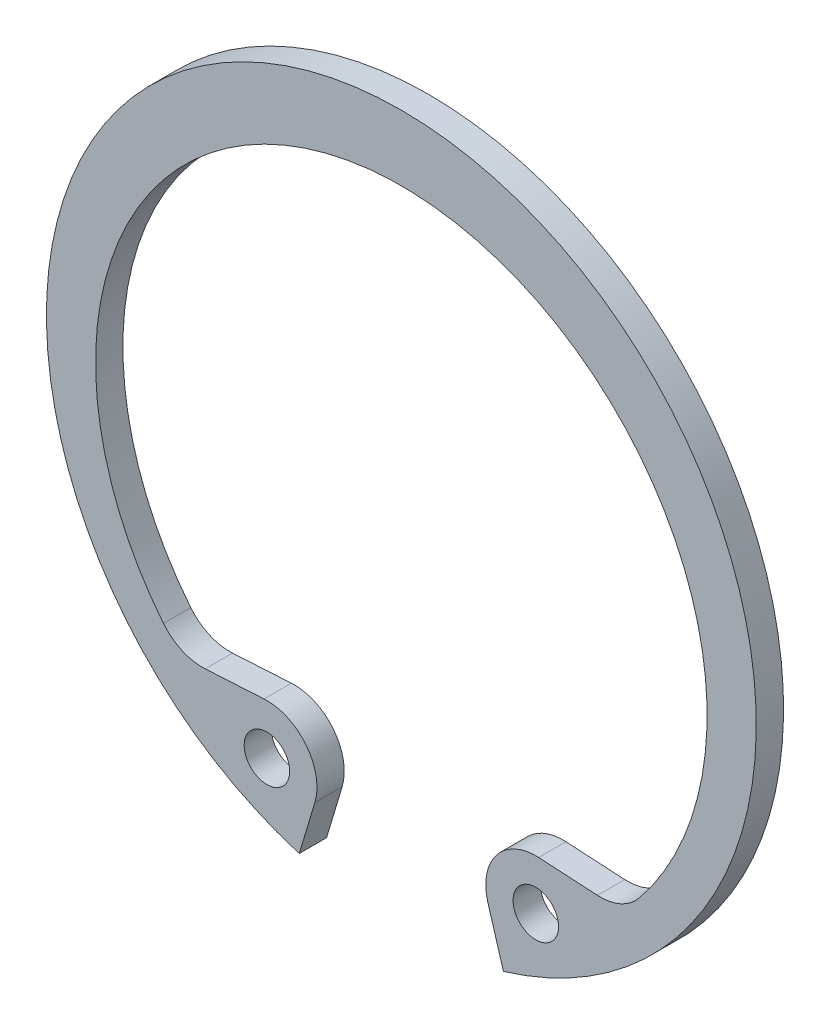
from build123d import *

# Parameters (mm, degrees)
ESQUISSE1_R          = 1.25
BASE_EXTRUSION_DEPTH = 1.5


with BuildPart() as part:
    # Esquisse1 → Base-Extrusion (new body)
    with BuildSketch(Plane.XY):
        with BuildLine():
            Line((4.752932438, -15.824336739), (5.609380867, -18.675782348))
            ThreePointArc((5.609380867, -18.675782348), (0, 19.5), (-5.609380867, -18.675782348))
            Line((-5.609380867, -18.675782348), (-4.752932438, -15.824336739))
            ThreePointArc((-4.752932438, -15.824336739), (-5.228027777, -13.329554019), (-7.544137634, -12.287780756))
            Line((-7.544137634, -12.287780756), (-10.773177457, -12.472951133))
            ThreePointArc((-10.773177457, -12.472951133), (-12.044624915, -12.241718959), (-13.070063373, -11.455256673))
            ThreePointArc((-13.070063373, -11.455256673), (0, 15.9), (13.070063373, -11.455256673))
            ThreePointArc((13.070063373, -11.455256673), (12.044624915, -12.241718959), (10.773177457, -12.472951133))
            Line((10.773177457, -12.472951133), (7.544137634, -12.287780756))
            ThreePointArc((7.544137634, -12.287780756), (5.228027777, -13.329554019), (4.752932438, -15.824336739))
        make_face()
        with Locations((7.386696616, -15.033270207)):
            Circle(ESQUISSE1_R, mode=Mode.SUBTRACT)
        with Locations(Location((-7.386696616, -15.033270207, 0), (0, 0, 180))):
            Circle(ESQUISSE1_R, mode=Mode.SUBTRACT)
    extrude(amount=BASE_EXTRUSION_DEPTH)


solid = part.part
